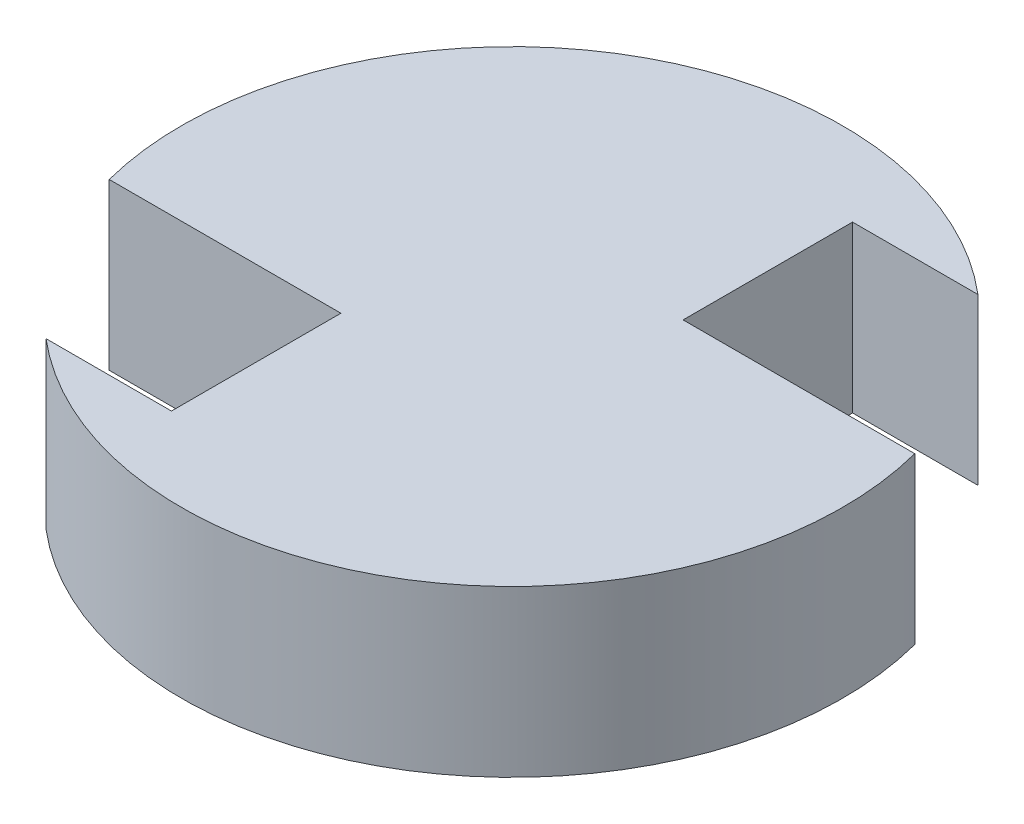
from build123d import *

# Parameters (mm, degrees)
SALIENTE_EXTRUIR2_DEPTH = 4


with BuildPart() as part:
    # Croquis1 → Saliente-Extruir2 (new body)
    with BuildSketch(Plane(origin=(0, 0, 0), x_dir=(1, 0, 0), z_dir=(0, 1, 0))):
        with BuildLine():
            Line((2.140043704, 6.1), (5.175905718, 6.1))
            ThreePointArc((5.175905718, 6.1), (-4.248976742, 6.778362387), (-7.745966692, -2))
            Line((-7.745966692, -2), (-2.140043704, -2))
            Line((-2.140043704, -2), (-2.140043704, -6.1))
            Line((-2.140043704, -6.1), (-5.175905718, -6.1))
            ThreePointArc((-5.175905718, -6.1), (4.248976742, -6.778362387), (7.745966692, 2))
            Line((7.745966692, 2), (2.140043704, 2))
            Line((2.140043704, 2), (2.140043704, 6.1))
        make_face()
    extrude(amount=SALIENTE_EXTRUIR2_DEPTH)


solid = part.part
